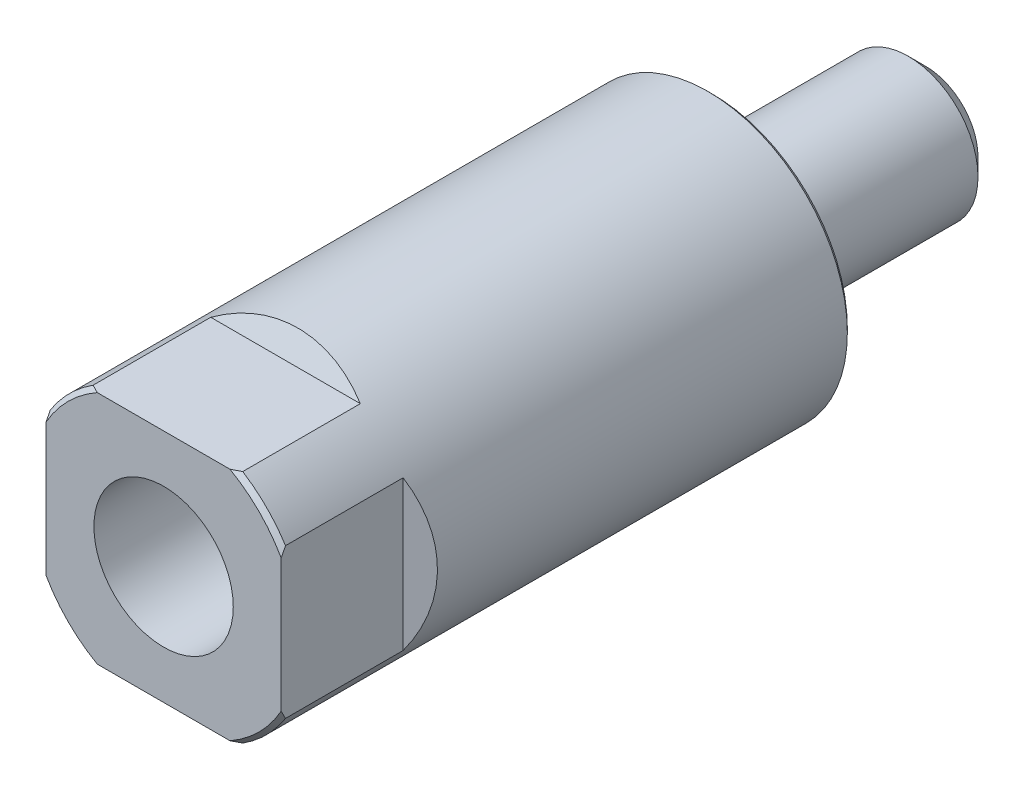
ISO-10303-21;
HEADER;
FILE_DESCRIPTION(('STEP AP214'),'2;1');
FILE_NAME('part.step','',(''),(''),'','','');
FILE_SCHEMA(('AUTOMOTIVE_DESIGN { 1 0 10303 214 1 1 1 1 }'));
ENDSEC;
DATA;
#1=APPLICATION_CONTEXT('core data for automotive mechanical design processes');
#2=APPLICATION_PROTOCOL_DEFINITION('international standard','automotive_design',2000,#1);
#3=PRODUCT_CONTEXT('',#1,'mechanical');
#4=PRODUCT('Part','Part','',(#3));
#5=PRODUCT_RELATED_PRODUCT_CATEGORY('part','',(#4));
#6=PRODUCT_DEFINITION_FORMATION('','',#4);
#7=PRODUCT_DEFINITION_CONTEXT('part definition',#1,'design');
#8=PRODUCT_DEFINITION('design','',#6,#7);
#9=PRODUCT_DEFINITION_SHAPE('','',#8);
#10=(LENGTH_UNIT() NAMED_UNIT(*) SI_UNIT(.MILLI.,.METRE.));
#11=(NAMED_UNIT(*) PLANE_ANGLE_UNIT() SI_UNIT($,.RADIAN.));
#12=(NAMED_UNIT(*) SI_UNIT($,.STERADIAN.) SOLID_ANGLE_UNIT());
#13=UNCERTAINTY_MEASURE_WITH_UNIT(LENGTH_MEASURE(1.E-05),#10,'distance_accuracy_value','');
#14=(GEOMETRIC_REPRESENTATION_CONTEXT(3) GLOBAL_UNCERTAINTY_ASSIGNED_CONTEXT((#13)) GLOBAL_UNIT_ASSIGNED_CONTEXT((#10,
#11,#12)) REPRESENTATION_CONTEXT('',''));
#15=CARTESIAN_POINT('',(0.,0.,0.));
#16=DIRECTION('',(0.,0.,1.));
#17=DIRECTION('',(1.,0.,0.));
#18=AXIS2_PLACEMENT_3D('',#15,#16,#17);
#19=CARTESIAN_POINT('',(0.,0.,-24.5));
#20=DIRECTION('',(0.,0.,1.));
#21=DIRECTION('',(1.,0.,0.));
#22=AXIS2_PLACEMENT_3D('',#19,#20,#21);
#23=PLANE('',#22);
#24=CARTESIAN_POINT('',(0.,0.,-24.5));
#25=DIRECTION('',(0.,0.,1.));
#26=DIRECTION('',(1.,0.,0.));
#27=AXIS2_PLACEMENT_3D('',#24,#25,#26);
#28=CIRCLE('',#27,6.);
#29=CARTESIAN_POINT('',(6.,0.,-24.5));
#30=VERTEX_POINT('',#29);
#31=EDGE_CURVE('E139',#30,#30,#28,.F.);
#32=ORIENTED_EDGE('',*,*,#31,.T.);
#33=EDGE_LOOP('',(#32));
#34=FACE_BOUND('',#33,.T.);
#35=ADVANCED_FACE('F14',(#34),#23,.F.);
#36=CARTESIAN_POINT('',(0.,0.,-4.5));
#37=DIRECTION('',(0.,0.,1.));
#38=DIRECTION('',(1.,0.,0.));
#39=AXIS2_PLACEMENT_3D('',#36,#37,#38);
#40=CYLINDRICAL_SURFACE('',#39,8.);
#41=CARTESIAN_POINT('',(0.,0.,-22.5));
#42=DIRECTION('',(0.,0.,1.));
#43=DIRECTION('',(1.,0.,0.));
#44=AXIS2_PLACEMENT_3D('',#41,#42,#43);
#45=CIRCLE('',#44,8.);
#46=CARTESIAN_POINT('',(8.,0.,-22.5));
#47=VERTEX_POINT('',#46);
#48=EDGE_CURVE('E175',#47,#47,#45,.T.);
#49=ORIENTED_EDGE('',*,*,#48,.T.);
#50=EDGE_LOOP('',(#49));
#51=FACE_BOUND('',#50,.T.);
#52=CARTESIAN_POINT('',(0.,0.,0.));
#53=DIRECTION('',(0.,0.,1.));
#54=DIRECTION('',(1.,0.,0.));
#55=AXIS2_PLACEMENT_3D('',#52,#53,#54);
#56=CIRCLE('',#55,8.);
#57=CARTESIAN_POINT('',(8.,0.,0.));
#58=VERTEX_POINT('',#57);
#59=EDGE_CURVE('E136',#58,#58,#56,.T.);
#60=ORIENTED_EDGE('',*,*,#59,.F.);
#61=EDGE_LOOP('',(#60));
#62=FACE_BOUND('',#61,.T.);
#63=ADVANCED_FACE('F426',(#51,#62),#40,.T.);
#64=CARTESIAN_POINT('',(8.,0.,15.5));
#65=DIRECTION('',(0.,0.,-1.));
#66=DIRECTION('',(-1.,0.,0.));
#67=AXIS2_PLACEMENT_3D('',#64,#65,#66);
#68=PLANE('',#67);
#69=CARTESIAN_POINT('',(0.,0.,15.5));
#70=DIRECTION('',(0.,0.,1.));
#71=DIRECTION('',(1.,0.,0.));
#72=AXIS2_PLACEMENT_3D('',#69,#70,#71);
#73=CIRCLE('',#72,8.);
#74=CARTESIAN_POINT('',(8.,0.,15.5));
#75=VERTEX_POINT('',#74);
#76=EDGE_CURVE('E121',#75,#75,#73,.T.);
#77=ORIENTED_EDGE('',*,*,#76,.T.);
#78=EDGE_LOOP('',(#77));
#79=FACE_BOUND('',#78,.T.);
#80=ADVANCED_FACE('F353',(#79),#68,.F.);
#81=CARTESIAN_POINT('',(13.5,-16.,49.));
#82=DIRECTION('',(-0.500000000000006,0.,-0.866025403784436));
#83=DIRECTION('',(-0.866025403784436,0.,0.500000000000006));
#84=AXIS2_PLACEMENT_3D('',#81,#82,#83);
#85=PLANE('',#84);
#86=CARTESIAN_POINT('',(0.,0.,56.7942286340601));
#87=DIRECTION('',(-0.500000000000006,0.,-0.866025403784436));
#88=DIRECTION('',(0.866025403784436,0.,-0.500000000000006));
#89=AXIS2_PLACEMENT_3D('',#86,#87,#88);
#90=ELLIPSE('',#89,18.4752086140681,16.);
#91=CARTESIAN_POINT('',(13.5,8.58778201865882,49.));
#92=VERTEX_POINT('',#91);
#93=CARTESIAN_POINT('',(13.5,-8.58778201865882,49.));
#94=VERTEX_POINT('',#93);
#95=EDGE_CURVE('E158',#92,#94,#90,.T.);
#96=ORIENTED_EDGE('',*,*,#95,.F.);
#97=DIRECTION('',(0.,1.,0.));
#98=VECTOR('',#97,1.);
#99=CARTESIAN_POINT('',(13.5,-16.,49.));
#100=LINE('',#99,#98);
#101=EDGE_CURVE('E149',#94,#92,#100,.T.);
#102=ORIENTED_EDGE('',*,*,#101,.F.);
#103=EDGE_LOOP('',(#96,#102));
#104=FACE_BOUND('',#103,.T.);
#105=ADVANCED_FACE('F223',(#104),#85,.F.);
#106=CARTESIAN_POINT('',(13.5,-16.,63.));
#107=DIRECTION('',(-1.,0.,0.));
#108=DIRECTION('',(0.,0.,1.));
#109=AXIS2_PLACEMENT_3D('',#106,#107,#108);
#110=PLANE('',#109);
#111=DIRECTION('',(0.,-1.,0.));
#112=VECTOR('',#111,1.);
#113=CARTESIAN_POINT('',(13.5,0.,63.));
#114=LINE('',#113,#112);
#115=CARTESIAN_POINT('',(13.5,7.6157731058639,63.));
#116=VERTEX_POINT('',#115);
#117=CARTESIAN_POINT('',(13.5,-7.61577310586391,63.));
#118=VERTEX_POINT('',#117);
#119=EDGE_CURVE('E156',#116,#118,#114,.T.);
#120=ORIENTED_EDGE('',*,*,#119,.T.);
#121=CARTESIAN_POINT('',(13.5,-7.61577310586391,63.));
#122=CARTESIAN_POINT('',(13.5,-7.69753487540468,62.9598269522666));
#123=CARTESIAN_POINT('',(13.5,-7.77910228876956,62.919259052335));
#124=CARTESIAN_POINT('',(13.5,-7.94184922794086,62.8373685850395));
#125=CARTESIAN_POINT('',(13.5,-8.02302878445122,62.7960460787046));
#126=CARTESIAN_POINT('',(13.5,-8.18501366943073,62.7126751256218));
#127=CARTESIAN_POINT('',(13.5,-8.2658189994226,62.6706266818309));
#128=CARTESIAN_POINT('',(13.5,-8.42706999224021,62.5858299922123));
#129=CARTESIAN_POINT('',(13.5,-8.50751562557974,62.5430816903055));
#130=CARTESIAN_POINT('',(13.5,-8.58778201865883,62.5));
#131=B_SPLINE_CURVE_WITH_KNOTS('',3,(#121,#122,#123,#124,#125,#126,#127,#128,#129,#130),
.UNSPECIFIED.,.F.,.F.,(4,2,2,2,4),(0.,0.273292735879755,0.546563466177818,0.819833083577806,
1.0931247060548),.UNSPECIFIED.);
#132=CARTESIAN_POINT('',(13.5,-8.58778201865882,62.5));
#133=VERTEX_POINT('',#132);
#134=EDGE_CURVE('E22',#118,#133,#131,.T.);
#135=ORIENTED_EDGE('',*,*,#134,.T.);
#136=DIRECTION('',(0.,0.,-1.));
#137=VECTOR('',#136,1.);
#138=CARTESIAN_POINT('',(13.5,-8.58778201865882,63.));
#139=LINE('',#138,#137);
#140=EDGE_CURVE('E152',#94,#133,#139,.F.);
#141=ORIENTED_EDGE('',*,*,#140,.F.);
#142=ORIENTED_EDGE('',*,*,#101,.T.);
#143=DIRECTION('',(0.,0.,-1.));
#144=VECTOR('',#143,1.);
#145=CARTESIAN_POINT('',(13.5,8.58778201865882,63.));
#146=LINE('',#145,#144);
#147=CARTESIAN_POINT('',(13.5,8.58778201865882,62.5));
#148=VERTEX_POINT('',#147);
#149=EDGE_CURVE('E154',#148,#92,#146,.T.);
#150=ORIENTED_EDGE('',*,*,#149,.F.);
#151=CARTESIAN_POINT('',(13.5,8.58778201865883,62.5));
#152=CARTESIAN_POINT('',(13.5,8.50751562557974,62.5430816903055));
#153=CARTESIAN_POINT('',(13.5,8.42706999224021,62.5858299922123));
#154=CARTESIAN_POINT('',(13.5,8.2658189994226,62.6706266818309));
#155=CARTESIAN_POINT('',(13.5,8.18501366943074,62.7126751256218));
#156=CARTESIAN_POINT('',(13.5,8.02302878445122,62.7960460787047));
#157=CARTESIAN_POINT('',(13.5,7.94184922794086,62.8373685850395));
#158=CARTESIAN_POINT('',(13.5,7.77910228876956,62.919259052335));
#159=CARTESIAN_POINT('',(13.5,7.69753487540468,62.9598269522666));
#160=CARTESIAN_POINT('',(13.5,7.61577310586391,63.));
#161=B_SPLINE_CURVE_WITH_KNOTS('',3,(#151,#152,#153,#154,#155,#156,#157,#158,#159,#160),
.UNSPECIFIED.,.F.,.F.,(4,2,2,2,4),(0.,0.273291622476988,0.546561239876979,0.819831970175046,
1.0931247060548),.UNSPECIFIED.);
#162=EDGE_CURVE('E227',#148,#116,#161,.T.);
#163=ORIENTED_EDGE('',*,*,#162,.T.);
#164=EDGE_LOOP('',(#120,#135,#141,#142,#150,#163));
#165=FACE_BOUND('',#164,.T.);
#166=ADVANCED_FACE('F217',(#165),#110,.F.);
#167=CARTESIAN_POINT('',(16.,13.5,49.));
#168=DIRECTION('',(0.,-0.500000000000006,-0.866025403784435));
#169=DIRECTION('',(0.,0.866025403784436,-0.500000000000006));
#170=AXIS2_PLACEMENT_3D('',#167,#168,#169);
#171=PLANE('',#170);
#172=CARTESIAN_POINT('',(0.,0.,56.7942286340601));
#173=DIRECTION('',(0.,-0.500000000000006,-0.866025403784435));
#174=DIRECTION('',(0.,0.866025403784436,-0.500000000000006));
#175=AXIS2_PLACEMENT_3D('',#172,#173,#174);
#176=ELLIPSE('',#175,18.4752086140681,16.);
#177=CARTESIAN_POINT('',(-8.58778201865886,13.5,49.));
#178=VERTEX_POINT('',#177);
#179=CARTESIAN_POINT('',(8.58778201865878,13.5,49.));
#180=VERTEX_POINT('',#179);
#181=EDGE_CURVE('E168',#178,#180,#176,.T.);
#182=ORIENTED_EDGE('',*,*,#181,.F.);
#183=DIRECTION('',(-1.,0.,0.));
#184=VECTOR('',#183,1.);
#185=CARTESIAN_POINT('',(16.,13.5,49.));
#186=LINE('',#185,#184);
#187=EDGE_CURVE('E114',#180,#178,#186,.T.);
#188=ORIENTED_EDGE('',*,*,#187,.F.);
#189=EDGE_LOOP('',(#182,#188));
#190=FACE_BOUND('',#189,.T.);
#191=ADVANCED_FACE('F222',(#190),#171,.F.);
#192=CARTESIAN_POINT('',(16.,13.5,63.));
#193=DIRECTION('',(0.,-1.,0.));
#194=DIRECTION('',(1.,0.,0.));
#195=AXIS2_PLACEMENT_3D('',#192,#193,#194);
#196=PLANE('',#195);
#197=DIRECTION('',(0.,0.,-1.));
#198=VECTOR('',#197,1.);
#199=CARTESIAN_POINT('',(-8.58778201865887,13.5,63.));
#200=LINE('',#199,#198);
#201=CARTESIAN_POINT('',(-8.58778201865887,13.5,62.5));
#202=VERTEX_POINT('',#201);
#203=EDGE_CURVE('E133',#202,#178,#200,.T.);
#204=ORIENTED_EDGE('',*,*,#203,.F.);
#205=CARTESIAN_POINT('',(-8.58778201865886,13.5,62.5));
#206=CARTESIAN_POINT('',(-8.50751562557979,13.4999999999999,62.5430816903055));
#207=CARTESIAN_POINT('',(-8.42706999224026,13.4999999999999,62.5858299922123));
#208=CARTESIAN_POINT('',(-8.26581899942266,13.4999999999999,62.6706266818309));
#209=CARTESIAN_POINT('',(-8.1850136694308,13.4999999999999,62.7126751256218));
#210=CARTESIAN_POINT('',(-8.02302878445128,13.4999999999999,62.7960460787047));
#211=CARTESIAN_POINT('',(-7.94184922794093,13.4999999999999,62.8373685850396));
#212=CARTESIAN_POINT('',(-7.77910228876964,13.4999999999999,62.919259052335));
#213=CARTESIAN_POINT('',(-7.69753487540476,13.4999999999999,62.9598269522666));
#214=CARTESIAN_POINT('',(-7.61577310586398,13.5,63.));
#215=B_SPLINE_CURVE_WITH_KNOTS('',3,(#205,#206,#207,#208,#209,#210,#211,#212,#213,#214),
.UNSPECIFIED.,.F.,.F.,(4,2,2,2,4),(0.,0.273291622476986,0.546561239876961,0.819831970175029,
1.09312470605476),.UNSPECIFIED.);
#216=CARTESIAN_POINT('',(-7.61577310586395,13.5,63.));
#217=VERTEX_POINT('',#216);
#218=EDGE_CURVE('E253',#202,#217,#215,.T.);
#219=ORIENTED_EDGE('',*,*,#218,.T.);
#220=DIRECTION('',(1.,0.,0.));
#221=VECTOR('',#220,1.);
#222=CARTESIAN_POINT('',(0.,13.5,63.));
#223=LINE('',#222,#221);
#224=CARTESIAN_POINT('',(7.61577310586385,13.5,63.));
#225=VERTEX_POINT('',#224);
#226=EDGE_CURVE('E165',#217,#225,#223,.T.);
#227=ORIENTED_EDGE('',*,*,#226,.T.);
#228=CARTESIAN_POINT('',(7.61577310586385,13.5,63.));
#229=CARTESIAN_POINT('',(7.69753487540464,13.5,62.9598269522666));
#230=CARTESIAN_POINT('',(7.77910228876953,13.5,62.919259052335));
#231=CARTESIAN_POINT('',(7.94184922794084,13.5,62.8373685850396));
#232=CARTESIAN_POINT('',(8.02302878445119,13.5,62.7960460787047));
#233=CARTESIAN_POINT('',(8.18501366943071,13.5,62.7126751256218));
#234=CARTESIAN_POINT('',(8.26581899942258,13.5,62.6706266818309));
#235=CARTESIAN_POINT('',(8.4270699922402,13.5,62.5858299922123));
#236=CARTESIAN_POINT('',(8.50751562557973,13.5,62.5430816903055));
#237=CARTESIAN_POINT('',(8.58778201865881,13.5,62.5));
#238=B_SPLINE_CURVE_WITH_KNOTS('',3,(#228,#229,#230,#231,#232,#233,#234,#235,#236,#237),
.UNSPECIFIED.,.F.,.F.,(4,2,2,2,4),(0.,0.273292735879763,0.546563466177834,0.819833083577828,
1.09312470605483),.UNSPECIFIED.);
#239=CARTESIAN_POINT('',(8.58778201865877,13.5,62.5));
#240=VERTEX_POINT('',#239);
#241=EDGE_CURVE('E274',#225,#240,#238,.T.);
#242=ORIENTED_EDGE('',*,*,#241,.T.);
#243=DIRECTION('',(0.,0.,-1.));
#244=VECTOR('',#243,1.);
#245=CARTESIAN_POINT('',(8.58778201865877,13.5,63.));
#246=LINE('',#245,#244);
#247=EDGE_CURVE('E131',#180,#240,#246,.F.);
#248=ORIENTED_EDGE('',*,*,#247,.F.);
#249=ORIENTED_EDGE('',*,*,#187,.T.);
#250=EDGE_LOOP('',(#204,#219,#227,#242,#248,#249));
#251=FACE_BOUND('',#250,.T.);
#252=ADVANCED_FACE('F267',(#251),#196,.F.);
#253=CARTESIAN_POINT('',(-13.5,-16.,49.));
#254=DIRECTION('',(0.5,0.,-0.866025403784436));
#255=DIRECTION('',(-0.866025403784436,0.,-0.5));
#256=AXIS2_PLACEMENT_3D('',#253,#254,#255);
#257=PLANE('',#256);
#258=CARTESIAN_POINT('',(0.,0.,56.79422863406));
#259=DIRECTION('',(0.5,0.,-0.866025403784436));
#260=DIRECTION('',(-0.866025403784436,0.,-0.5));
#261=AXIS2_PLACEMENT_3D('',#258,#259,#260);
#262=ELLIPSE('',#261,18.4752086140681,16.);
#263=CARTESIAN_POINT('',(-13.5,-8.58778201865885,49.));
#264=VERTEX_POINT('',#263);
#265=CARTESIAN_POINT('',(-13.5,8.58778201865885,49.));
#266=VERTEX_POINT('',#265);
#267=EDGE_CURVE('E163',#264,#266,#262,.T.);
#268=ORIENTED_EDGE('',*,*,#267,.F.);
#269=DIRECTION('',(0.,1.,0.));
#270=VECTOR('',#269,1.);
#271=CARTESIAN_POINT('',(-13.5,-16.,49.));
#272=LINE('',#271,#270);
#273=EDGE_CURVE('E142',#264,#266,#272,.T.);
#274=ORIENTED_EDGE('',*,*,#273,.T.);
#275=EDGE_LOOP('',(#268,#274));
#276=FACE_BOUND('',#275,.T.);
#277=ADVANCED_FACE('F213',(#276),#257,.F.);
#278=CARTESIAN_POINT('',(-13.5,-16.,63.));
#279=DIRECTION('',(1.,0.,0.));
#280=DIRECTION('',(0.,0.,-1.));
#281=AXIS2_PLACEMENT_3D('',#278,#279,#280);
#282=PLANE('',#281);
#283=DIRECTION('',(0.,1.,0.));
#284=VECTOR('',#283,1.);
#285=CARTESIAN_POINT('',(-13.5,0.,63.));
#286=LINE('',#285,#284);
#287=CARTESIAN_POINT('',(-13.5,-7.61577310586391,63.));
#288=VERTEX_POINT('',#287);
#289=CARTESIAN_POINT('',(-13.5,7.61577310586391,63.));
#290=VERTEX_POINT('',#289);
#291=EDGE_CURVE('E160',#288,#290,#286,.T.);
#292=ORIENTED_EDGE('',*,*,#291,.T.);
#293=CARTESIAN_POINT('',(-13.5,7.61577310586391,63.));
#294=CARTESIAN_POINT('',(-13.5,7.69753487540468,62.9598269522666));
#295=CARTESIAN_POINT('',(-13.5,7.77910228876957,62.919259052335));
#296=CARTESIAN_POINT('',(-13.5,7.94184922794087,62.8373685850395));
#297=CARTESIAN_POINT('',(-13.5,8.02302878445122,62.7960460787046));
#298=CARTESIAN_POINT('',(-13.5,8.18501366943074,62.7126751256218));
#299=CARTESIAN_POINT('',(-13.5,8.2658189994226,62.6706266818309));
#300=CARTESIAN_POINT('',(-13.5,8.42706999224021,62.5858299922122));
#301=CARTESIAN_POINT('',(-13.5,8.50751562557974,62.5430816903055));
#302=CARTESIAN_POINT('',(-13.5,8.58778201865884,62.5));
#303=B_SPLINE_CURVE_WITH_KNOTS('',3,(#293,#294,#295,#296,#297,#298,#299,#300,#301,#302),
.UNSPECIFIED.,.F.,.F.,(4,2,2,2,4),(0.,0.273292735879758,0.546563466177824,0.819833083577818,
1.0931247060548),.UNSPECIFIED.);
#304=CARTESIAN_POINT('',(-13.5,8.58778201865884,62.5));
#305=VERTEX_POINT('',#304);
#306=EDGE_CURVE('E198',#290,#305,#303,.T.);
#307=ORIENTED_EDGE('',*,*,#306,.T.);
#308=DIRECTION('',(0.,0.,-1.));
#309=VECTOR('',#308,1.);
#310=CARTESIAN_POINT('',(-13.5,8.58778201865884,63.));
#311=LINE('',#310,#309);
#312=EDGE_CURVE('E145',#266,#305,#311,.F.);
#313=ORIENTED_EDGE('',*,*,#312,.F.);
#314=ORIENTED_EDGE('',*,*,#273,.F.);
#315=DIRECTION('',(0.,0.,-1.));
#316=VECTOR('',#315,1.);
#317=CARTESIAN_POINT('',(-13.5,-8.58778201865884,63.));
#318=LINE('',#317,#316);
#319=CARTESIAN_POINT('',(-13.5,-8.58778201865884,62.5));
#320=VERTEX_POINT('',#319);
#321=EDGE_CURVE('E147',#320,#264,#318,.T.);
#322=ORIENTED_EDGE('',*,*,#321,.F.);
#323=CARTESIAN_POINT('',(-13.5,-8.58778201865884,62.5));
#324=CARTESIAN_POINT('',(-13.5,-8.50751562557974,62.5430816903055));
#325=CARTESIAN_POINT('',(-13.5,-8.42706999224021,62.5858299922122));
#326=CARTESIAN_POINT('',(-13.5,-8.2658189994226,62.6706266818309));
#327=CARTESIAN_POINT('',(-13.5,-8.18501366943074,62.7126751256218));
#328=CARTESIAN_POINT('',(-13.5,-8.02302878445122,62.7960460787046));
#329=CARTESIAN_POINT('',(-13.5,-7.94184922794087,62.8373685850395));
#330=CARTESIAN_POINT('',(-13.5,-7.77910228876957,62.919259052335));
#331=CARTESIAN_POINT('',(-13.5,-7.69753487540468,62.9598269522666));
#332=CARTESIAN_POINT('',(-13.5,-7.61577310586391,63.));
#333=B_SPLINE_CURVE_WITH_KNOTS('',3,(#323,#324,#325,#326,#327,#328,#329,#330,#331,#332),
.UNSPECIFIED.,.F.,.F.,(4,2,2,2,4),(0.,0.273291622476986,0.54656123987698,0.819831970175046,
1.0931247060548),.UNSPECIFIED.);
#334=EDGE_CURVE('E190',#320,#288,#333,.T.);
#335=ORIENTED_EDGE('',*,*,#334,.T.);
#336=EDGE_LOOP('',(#292,#307,#313,#314,#322,#335));
#337=FACE_BOUND('',#336,.T.);
#338=ADVANCED_FACE('F208',(#337),#282,.F.);
#339=CARTESIAN_POINT('',(16.,-13.5,49.));
#340=DIRECTION('',(0.,0.5,-0.866025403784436));
#341=DIRECTION('',(0.,0.866025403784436,0.5));
#342=AXIS2_PLACEMENT_3D('',#339,#340,#341);
#343=PLANE('',#342);
#344=CARTESIAN_POINT('',(0.,0.,56.7942286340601));
#345=DIRECTION('',(0.,0.5,-0.866025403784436));
#346=DIRECTION('',(0.,-0.866025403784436,-0.5));
#347=AXIS2_PLACEMENT_3D('',#344,#345,#346);
#348=ELLIPSE('',#347,18.4752086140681,16.);
#349=CARTESIAN_POINT('',(8.58778201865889,-13.5,49.));
#350=VERTEX_POINT('',#349);
#351=CARTESIAN_POINT('',(-8.58778201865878,-13.5,49.));
#352=VERTEX_POINT('',#351);
#353=EDGE_CURVE('E107',#350,#352,#348,.T.);
#354=ORIENTED_EDGE('',*,*,#353,.F.);
#355=DIRECTION('',(-1.,0.,0.));
#356=VECTOR('',#355,1.);
#357=CARTESIAN_POINT('',(16.,-13.5,49.));
#358=LINE('',#357,#356);
#359=EDGE_CURVE('E120',#350,#352,#358,.T.);
#360=ORIENTED_EDGE('',*,*,#359,.T.);
#361=EDGE_LOOP('',(#354,#360));
#362=FACE_BOUND('',#361,.T.);
#363=ADVANCED_FACE('F119',(#362),#343,.F.);
#364=CARTESIAN_POINT('',(16.,-13.5,63.));
#365=DIRECTION('',(0.,1.,0.));
#366=DIRECTION('',(-1.,0.,0.));
#367=AXIS2_PLACEMENT_3D('',#364,#365,#366);
#368=PLANE('',#367);
#369=DIRECTION('',(-1.,0.,0.));
#370=VECTOR('',#369,1.);
#371=CARTESIAN_POINT('',(0.,-13.5,63.));
#372=LINE('',#371,#370);
#373=CARTESIAN_POINT('',(7.61577310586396,-13.5,63.));
#374=VERTEX_POINT('',#373);
#375=CARTESIAN_POINT('',(-7.61577310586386,-13.5,63.));
#376=VERTEX_POINT('',#375);
#377=EDGE_CURVE('E122',#374,#376,#372,.T.);
#378=ORIENTED_EDGE('',*,*,#377,.T.);
#379=CARTESIAN_POINT('',(-7.61577310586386,-13.5,63.));
#380=CARTESIAN_POINT('',(-7.69753487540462,-13.5000000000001,62.9598269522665));
#381=CARTESIAN_POINT('',(-7.77910228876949,-13.5000000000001,62.9192590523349));
#382=CARTESIAN_POINT('',(-7.94184922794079,-13.5000000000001,62.8373685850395));
#383=CARTESIAN_POINT('',(-8.02302878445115,-13.5000000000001,62.7960460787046));
#384=CARTESIAN_POINT('',(-8.18501366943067,-13.5000000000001,62.7126751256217));
#385=CARTESIAN_POINT('',(-8.26581899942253,-13.5000000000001,62.6706266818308));
#386=CARTESIAN_POINT('',(-8.42706999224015,-13.5000000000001,62.5858299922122));
#387=CARTESIAN_POINT('',(-8.50751562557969,-13.5000000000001,62.5430816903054));
#388=CARTESIAN_POINT('',(-8.58778201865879,-13.5,62.5));
#389=B_SPLINE_CURVE_WITH_KNOTS('',3,(#379,#380,#381,#382,#383,#384,#385,#386,#387,#388),
.UNSPECIFIED.,.F.,.F.,(4,2,2,2,4),(0.,0.273292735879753,0.546563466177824,0.819833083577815,
1.0931247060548),.UNSPECIFIED.);
#390=CARTESIAN_POINT('',(-8.5877820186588,-13.5,62.5));
#391=VERTEX_POINT('',#390);
#392=EDGE_CURVE('E252',#376,#391,#389,.T.);
#393=ORIENTED_EDGE('',*,*,#392,.T.);
#394=DIRECTION('',(0.,0.,-1.));
#395=VECTOR('',#394,1.);
#396=CARTESIAN_POINT('',(-8.5877820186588,-13.5,63.));
#397=LINE('',#396,#395);
#398=EDGE_CURVE('E115',#352,#391,#397,.F.);
#399=ORIENTED_EDGE('',*,*,#398,.F.);
#400=ORIENTED_EDGE('',*,*,#359,.F.);
#401=DIRECTION('',(0.,0.,-1.));
#402=VECTOR('',#401,1.);
#403=CARTESIAN_POINT('',(8.58778201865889,-13.5,63.));
#404=LINE('',#403,#402);
#405=CARTESIAN_POINT('',(8.58778201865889,-13.5,62.5));
#406=VERTEX_POINT('',#405);
#407=EDGE_CURVE('E102',#406,#350,#404,.T.);
#408=ORIENTED_EDGE('',*,*,#407,.F.);
#409=CARTESIAN_POINT('',(8.58778201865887,-13.5,62.5));
#410=CARTESIAN_POINT('',(8.50751562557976,-13.5,62.5430816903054));
#411=CARTESIAN_POINT('',(8.42706999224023,-13.5,62.5858299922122));
#412=CARTESIAN_POINT('',(8.26581899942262,-13.5,62.6706266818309));
#413=CARTESIAN_POINT('',(8.18501366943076,-13.5,62.7126751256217));
#414=CARTESIAN_POINT('',(8.02302878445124,-13.5,62.7960460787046));
#415=CARTESIAN_POINT('',(7.94184922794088,-13.5,62.8373685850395));
#416=CARTESIAN_POINT('',(7.77910228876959,-13.5,62.919259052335));
#417=CARTESIAN_POINT('',(7.69753487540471,-13.5,62.9598269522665));
#418=CARTESIAN_POINT('',(7.61577310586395,-13.5,63.));
#419=B_SPLINE_CURVE_WITH_KNOTS('',3,(#409,#410,#411,#412,#413,#414,#415,#416,#417,#418),
.UNSPECIFIED.,.F.,.F.,(4,2,2,2,4),(0.,0.273291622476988,0.546561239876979,0.819831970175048,
1.0931247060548),.UNSPECIFIED.);
#420=EDGE_CURVE('E245',#406,#374,#419,.T.);
#421=ORIENTED_EDGE('',*,*,#420,.T.);
#422=EDGE_LOOP('',(#378,#393,#399,#400,#408,#421));
#423=FACE_BOUND('',#422,.T.);
#424=ADVANCED_FACE('F125',(#423),#368,.F.);
#425=CARTESIAN_POINT('',(0.,0.,63.));
#426=DIRECTION('',(0.,0.,-1.));
#427=DIRECTION('',(-1.,0.,0.));
#428=AXIS2_PLACEMENT_3D('',#425,#426,#427);
#429=CYLINDRICAL_SURFACE('',#428,16.);
#430=CARTESIAN_POINT('',(0.,0.,0.5));
#431=DIRECTION('',(0.,0.,1.));
#432=DIRECTION('',(1.,0.,0.));
#433=AXIS2_PLACEMENT_3D('',#430,#431,#432);
#434=CIRCLE('',#433,16.);
#435=CARTESIAN_POINT('',(16.,0.,0.5));
#436=VERTEX_POINT('',#435);
#437=EDGE_CURVE('E285',#436,#436,#434,.T.);
#438=ORIENTED_EDGE('',*,*,#437,.T.);
#439=EDGE_LOOP('',(#438));
#440=FACE_BOUND('',#439,.T.);
#441=ORIENTED_EDGE('',*,*,#312,.T.);
#442=CARTESIAN_POINT('',(0.,0.,62.5));
#443=DIRECTION('',(0.,0.,1.));
#444=DIRECTION('',(1.,0.,0.));
#445=AXIS2_PLACEMENT_3D('',#442,#443,#444);
#446=CIRCLE('',#445,16.);
#447=EDGE_CURVE('E280',#305,#202,#446,.F.);
#448=ORIENTED_EDGE('',*,*,#447,.T.);
#449=ORIENTED_EDGE('',*,*,#203,.T.);
#450=ORIENTED_EDGE('',*,*,#181,.T.);
#451=ORIENTED_EDGE('',*,*,#247,.T.);
#452=CARTESIAN_POINT('',(0.,0.,62.5));
#453=DIRECTION('',(0.,0.,1.));
#454=DIRECTION('',(1.,0.,0.));
#455=AXIS2_PLACEMENT_3D('',#452,#453,#454);
#456=CIRCLE('',#455,16.);
#457=EDGE_CURVE('E36',#240,#148,#456,.F.);
#458=ORIENTED_EDGE('',*,*,#457,.T.);
#459=ORIENTED_EDGE('',*,*,#149,.T.);
#460=ORIENTED_EDGE('',*,*,#95,.T.);
#461=ORIENTED_EDGE('',*,*,#140,.T.);
#462=CARTESIAN_POINT('',(0.,0.,62.5));
#463=DIRECTION('',(0.,0.,1.));
#464=DIRECTION('',(1.,0.,0.));
#465=AXIS2_PLACEMENT_3D('',#462,#463,#464);
#466=CIRCLE('',#465,16.);
#467=EDGE_CURVE('E110',#133,#406,#466,.F.);
#468=ORIENTED_EDGE('',*,*,#467,.T.);
#469=ORIENTED_EDGE('',*,*,#407,.T.);
#470=ORIENTED_EDGE('',*,*,#353,.T.);
#471=ORIENTED_EDGE('',*,*,#398,.T.);
#472=CARTESIAN_POINT('',(0.,0.,62.5));
#473=DIRECTION('',(0.,0.,1.));
#474=DIRECTION('',(1.,0.,0.));
#475=AXIS2_PLACEMENT_3D('',#472,#473,#474);
#476=CIRCLE('',#475,16.);
#477=EDGE_CURVE('E282',#391,#320,#476,.F.);
#478=ORIENTED_EDGE('',*,*,#477,.T.);
#479=ORIENTED_EDGE('',*,*,#321,.T.);
#480=ORIENTED_EDGE('',*,*,#267,.T.);
#481=EDGE_LOOP('',(#441,#448,#449,#450,#451,#458,#459,#460,#461,#468,#469,#470,#471,#478,#479,#480));
#482=FACE_BOUND('',#481,.T.);
#483=ADVANCED_FACE('F105',(#440,#482),#429,.T.);
#484=CARTESIAN_POINT('',(0.,0.,0.));
#485=DIRECTION('',(0.,0.,1.));
#486=DIRECTION('',(1.,0.,0.));
#487=AXIS2_PLACEMENT_3D('',#484,#485,#486);
#488=PLANE('',#487);
#489=CARTESIAN_POINT('',(0.,0.,0.));
#490=DIRECTION('',(0.,0.,1.));
#491=DIRECTION('',(1.,0.,0.));
#492=AXIS2_PLACEMENT_3D('',#489,#490,#491);
#493=CIRCLE('',#492,15.5);
#494=CARTESIAN_POINT('',(15.5,0.,0.));
#495=VERTEX_POINT('',#494);
#496=EDGE_CURVE('E9',#495,#495,#493,.F.);
#497=ORIENTED_EDGE('',*,*,#496,.T.);
#498=EDGE_LOOP('',(#497));
#499=FACE_BOUND('',#498,.T.);
#500=ORIENTED_EDGE('',*,*,#59,.T.);
#501=EDGE_LOOP('',(#500));
#502=FACE_BOUND('',#501,.T.);
#503=ADVANCED_FACE('F320',(#499,#502),#488,.F.);
#504=CARTESIAN_POINT('',(0.,0.,63.));
#505=DIRECTION('',(0.,0.,1.));
#506=DIRECTION('',(1.,0.,0.));
#507=AXIS2_PLACEMENT_3D('',#504,#505,#506);
#508=PLANE('',#507);
#509=ORIENTED_EDGE('',*,*,#226,.F.);
#510=CARTESIAN_POINT('',(0.,0.,63.));
#511=DIRECTION('',(0.,0.,1.));
#512=DIRECTION('',(1.,0.,0.));
#513=AXIS2_PLACEMENT_3D('',#510,#511,#512);
#514=CIRCLE('',#513,15.5);
#515=EDGE_CURVE('E187',#217,#290,#514,.T.);
#516=ORIENTED_EDGE('',*,*,#515,.T.);
#517=ORIENTED_EDGE('',*,*,#291,.F.);
#518=CARTESIAN_POINT('',(0.,0.,63.));
#519=DIRECTION('',(0.,0.,1.));
#520=DIRECTION('',(1.,0.,0.));
#521=AXIS2_PLACEMENT_3D('',#518,#519,#520);
#522=CIRCLE('',#521,15.5);
#523=EDGE_CURVE('E184',#288,#376,#522,.T.);
#524=ORIENTED_EDGE('',*,*,#523,.T.);
#525=ORIENTED_EDGE('',*,*,#377,.F.);
#526=CARTESIAN_POINT('',(0.,0.,63.));
#527=DIRECTION('',(0.,0.,1.));
#528=DIRECTION('',(1.,0.,0.));
#529=AXIS2_PLACEMENT_3D('',#526,#527,#528);
#530=CIRCLE('',#529,15.5);
#531=EDGE_CURVE('E181',#374,#118,#530,.T.);
#532=ORIENTED_EDGE('',*,*,#531,.T.);
#533=ORIENTED_EDGE('',*,*,#119,.F.);
#534=CARTESIAN_POINT('',(0.,0.,63.));
#535=DIRECTION('',(0.,0.,1.));
#536=DIRECTION('',(1.,0.,0.));
#537=AXIS2_PLACEMENT_3D('',#534,#535,#536);
#538=CIRCLE('',#537,15.5);
#539=EDGE_CURVE('E178',#116,#225,#538,.T.);
#540=ORIENTED_EDGE('',*,*,#539,.T.);
#541=EDGE_LOOP('',(#509,#516,#517,#524,#525,#532,#533,#540));
#542=FACE_BOUND('',#541,.T.);
#543=CARTESIAN_POINT('',(0.,0.,63.));
#544=DIRECTION('',(0.,0.,1.));
#545=DIRECTION('',(1.,0.,0.));
#546=AXIS2_PLACEMENT_3D('',#543,#544,#545);
#547=CIRCLE('',#546,8.);
#548=CARTESIAN_POINT('',(8.,0.,63.));
#549=VERTEX_POINT('',#548);
#550=EDGE_CURVE('E135',#549,#549,#547,.T.);
#551=ORIENTED_EDGE('',*,*,#550,.F.);
#552=EDGE_LOOP('',(#551));
#553=FACE_BOUND('',#552,.T.);
#554=ADVANCED_FACE('F301',(#542,#553),#508,.T.);
#555=CARTESIAN_POINT('',(0.,0.,63.));
#556=DIRECTION('',(0.,0.,1.));
#557=DIRECTION('',(1.,0.,0.));
#558=AXIS2_PLACEMENT_3D('',#555,#556,#557);
#559=CYLINDRICAL_SURFACE('',#558,8.);
#560=ORIENTED_EDGE('',*,*,#76,.F.);
#561=EDGE_LOOP('',(#560));
#562=FACE_BOUND('',#561,.T.);
#563=ORIENTED_EDGE('',*,*,#550,.T.);
#564=EDGE_LOOP('',(#563));
#565=FACE_BOUND('',#564,.T.);
#566=ADVANCED_FACE('F215',(#562,#565),#559,.F.);
#567=CARTESIAN_POINT('',(0.,0.,-24.5));
#568=DIRECTION('',(0.,0.,1.));
#569=DIRECTION('',(1.,0.,0.));
#570=AXIS2_PLACEMENT_3D('',#567,#568,#569);
#571=CONICAL_SURFACE('',#570,6.,0.785398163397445);
#572=ORIENTED_EDGE('',*,*,#48,.F.);
#573=EDGE_LOOP('',(#572));
#574=FACE_BOUND('',#573,.T.);
#575=ORIENTED_EDGE('',*,*,#31,.F.);
#576=EDGE_LOOP('',(#575));
#577=FACE_BOUND('',#576,.T.);
#578=ADVANCED_FACE('F317',(#574,#577),#571,.T.);
#579=CARTESIAN_POINT('',(0.,0.,63.));
#580=DIRECTION('',(0.,0.,-1.));
#581=DIRECTION('',(-1.,0.,0.));
#582=AXIS2_PLACEMENT_3D('',#579,#580,#581);
#583=CONICAL_SURFACE('',#582,15.5,0.785398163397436);
#584=ORIENTED_EDGE('',*,*,#218,.F.);
#585=ORIENTED_EDGE('',*,*,#447,.F.);
#586=ORIENTED_EDGE('',*,*,#306,.F.);
#587=ORIENTED_EDGE('',*,*,#515,.F.);
#588=EDGE_LOOP('',(#584,#585,#586,#587));
#589=FACE_BOUND('',#588,.T.);
#590=ADVANCED_FACE('F298',(#589),#583,.T.);
#591=CARTESIAN_POINT('',(0.,0.,63.));
#592=DIRECTION('',(0.,0.,-1.));
#593=DIRECTION('',(-1.,0.,0.));
#594=AXIS2_PLACEMENT_3D('',#591,#592,#593);
#595=CONICAL_SURFACE('',#594,15.5,0.785398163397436);
#596=ORIENTED_EDGE('',*,*,#334,.F.);
#597=ORIENTED_EDGE('',*,*,#477,.F.);
#598=ORIENTED_EDGE('',*,*,#392,.F.);
#599=ORIENTED_EDGE('',*,*,#523,.F.);
#600=EDGE_LOOP('',(#596,#597,#598,#599));
#601=FACE_BOUND('',#600,.T.);
#602=ADVANCED_FACE('F205',(#601),#595,.T.);
#603=CARTESIAN_POINT('',(0.,0.,63.));
#604=DIRECTION('',(0.,0.,-1.));
#605=DIRECTION('',(-1.,0.,0.));
#606=AXIS2_PLACEMENT_3D('',#603,#604,#605);
#607=CONICAL_SURFACE('',#606,15.5,0.785398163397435);
#608=ORIENTED_EDGE('',*,*,#420,.F.);
#609=ORIENTED_EDGE('',*,*,#467,.F.);
#610=ORIENTED_EDGE('',*,*,#134,.F.);
#611=ORIENTED_EDGE('',*,*,#531,.F.);
#612=EDGE_LOOP('',(#608,#609,#610,#611));
#613=FACE_BOUND('',#612,.T.);
#614=ADVANCED_FACE('F237',(#613),#607,.T.);
#615=CARTESIAN_POINT('',(0.,0.,63.));
#616=DIRECTION('',(0.,0.,-1.));
#617=DIRECTION('',(-1.,0.,0.));
#618=AXIS2_PLACEMENT_3D('',#615,#616,#617);
#619=CONICAL_SURFACE('',#618,15.5,0.785398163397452);
#620=ORIENTED_EDGE('',*,*,#162,.F.);
#621=ORIENTED_EDGE('',*,*,#457,.F.);
#622=ORIENTED_EDGE('',*,*,#241,.F.);
#623=ORIENTED_EDGE('',*,*,#539,.F.);
#624=EDGE_LOOP('',(#620,#621,#622,#623));
#625=FACE_BOUND('',#624,.T.);
#626=ADVANCED_FACE('F240',(#625),#619,.T.);
#627=CARTESIAN_POINT('',(0.,0.,0.5));
#628=DIRECTION('',(0.,0.,1.));
#629=DIRECTION('',(1.,0.,0.));
#630=AXIS2_PLACEMENT_3D('',#627,#628,#629);
#631=CONICAL_SURFACE('',#630,16.,0.785398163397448);
#632=ORIENTED_EDGE('',*,*,#496,.F.);
#633=EDGE_LOOP('',(#632));
#634=FACE_BOUND('',#633,.T.);
#635=ORIENTED_EDGE('',*,*,#437,.F.);
#636=EDGE_LOOP('',(#635));
#637=FACE_BOUND('',#636,.T.);
#638=ADVANCED_FACE('F16',(#634,#637),#631,.T.);
#639=CLOSED_SHELL('',(#35,#63,#80,#105,#166,#191,#252,#277,#338,#363,#424,#483,#503,#554,#566,
#578,#590,#602,#614,#626,#638));
#640=MANIFOLD_SOLID_BREP('B1',#639);
#641=ADVANCED_BREP_SHAPE_REPRESENTATION('',(#18,#640),#14);
#642=SHAPE_DEFINITION_REPRESENTATION(#9,#641);
ENDSEC;
END-ISO-10303-21;
